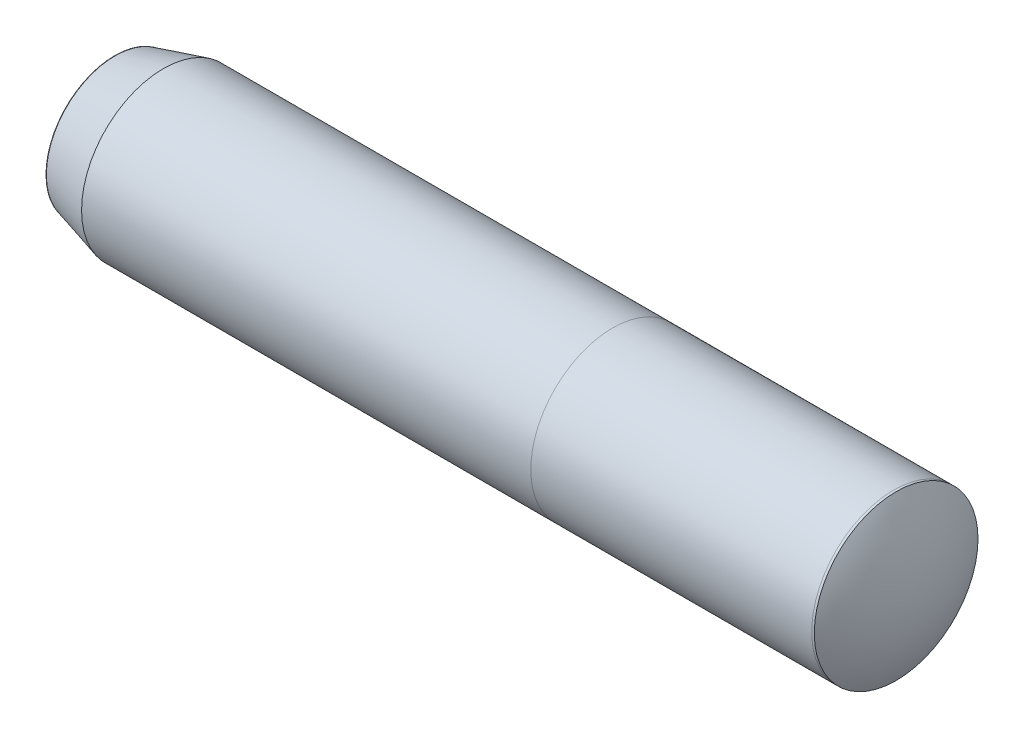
ISO-10303-21;
HEADER;
FILE_DESCRIPTION(('STEP AP214'),'2;1');
FILE_NAME('part.step','',(''),(''),'','','');
FILE_SCHEMA(('AUTOMOTIVE_DESIGN { 1 0 10303 214 1 1 1 1 }'));
ENDSEC;
DATA;
#1=APPLICATION_CONTEXT('core data for automotive mechanical design processes');
#2=APPLICATION_PROTOCOL_DEFINITION('international standard','automotive_design',2000,#1);
#3=PRODUCT_CONTEXT('',#1,'mechanical');
#4=PRODUCT('Part','Part','',(#3));
#5=PRODUCT_RELATED_PRODUCT_CATEGORY('part','',(#4));
#6=PRODUCT_DEFINITION_FORMATION('','',#4);
#7=PRODUCT_DEFINITION_CONTEXT('part definition',#1,'design');
#8=PRODUCT_DEFINITION('design','',#6,#7);
#9=PRODUCT_DEFINITION_SHAPE('','',#8);
#10=(LENGTH_UNIT() NAMED_UNIT(*) SI_UNIT(.MILLI.,.METRE.));
#11=(NAMED_UNIT(*) PLANE_ANGLE_UNIT() SI_UNIT($,.RADIAN.));
#12=(NAMED_UNIT(*) SI_UNIT($,.STERADIAN.) SOLID_ANGLE_UNIT());
#13=UNCERTAINTY_MEASURE_WITH_UNIT(LENGTH_MEASURE(1.E-05),#10,'distance_accuracy_value','');
#14=(GEOMETRIC_REPRESENTATION_CONTEXT(3) GLOBAL_UNCERTAINTY_ASSIGNED_CONTEXT((#13)) GLOBAL_UNIT_ASSIGNED_CONTEXT((#10,
#11,#12)) REPRESENTATION_CONTEXT('',''));
#15=CARTESIAN_POINT('',(0.,0.,0.));
#16=DIRECTION('',(0.,0.,1.));
#17=DIRECTION('',(1.,0.,0.));
#18=AXIS2_PLACEMENT_3D('',#15,#16,#17);
#19=CARTESIAN_POINT('',(0.78,0.,0.));
#20=DIRECTION('',(1.,0.,0.));
#21=DIRECTION('',(0.,1.,0.));
#22=AXIS2_PLACEMENT_3D('',#19,#20,#21);
#23=CYLINDRICAL_SURFACE('',#22,1.);
#24=CARTESIAN_POINT('',(9.7,0.,0.));
#25=DIRECTION('',(1.,0.,0.));
#26=DIRECTION('',(0.,0.,-1.));
#27=AXIS2_PLACEMENT_3D('',#24,#25,#26);
#28=CIRCLE('',#27,1.);
#29=CARTESIAN_POINT('',(9.7,0.,-0.999999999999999));
#30=VERTEX_POINT('',#29);
#31=EDGE_CURVE('E20',#30,#30,#28,.T.);
#32=ORIENTED_EDGE('',*,*,#31,.F.);
#33=EDGE_LOOP('',(#32));
#34=FACE_BOUND('',#33,.T.);
#35=CARTESIAN_POINT('',(6.26794919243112,0.,0.));
#36=DIRECTION('',(1.,0.,0.));
#37=DIRECTION('',(0.,0.,-1.));
#38=AXIS2_PLACEMENT_3D('',#35,#36,#37);
#39=CIRCLE('',#38,1.);
#40=CARTESIAN_POINT('',(6.26794919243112,0.,-1.));
#41=VERTEX_POINT('',#40);
#42=EDGE_CURVE('E9',#41,#41,#39,.T.);
#43=ORIENTED_EDGE('',*,*,#42,.T.);
#44=EDGE_LOOP('',(#43));
#45=FACE_BOUND('',#44,.T.);
#46=ADVANCED_FACE('F13',(#34,#45),#23,.T.);
#47=ORIENTED_EDGE('',*,*,#42,.F.);
#48=EDGE_LOOP('',(#47));
#49=FACE_BOUND('',#48,.T.);
#50=CARTESIAN_POINT('',(0.78,0.,0.));
#51=DIRECTION('',(-1.,0.,0.));
#52=DIRECTION('',(0.,0.,1.));
#53=AXIS2_PLACEMENT_3D('',#50,#51,#52);
#54=CIRCLE('',#53,1.);
#55=CARTESIAN_POINT('',(0.78,0.,1.));
#56=VERTEX_POINT('',#55);
#57=EDGE_CURVE('E28',#56,#56,#54,.T.);
#58=ORIENTED_EDGE('',*,*,#57,.F.);
#59=EDGE_LOOP('',(#58));
#60=FACE_BOUND('',#59,.T.);
#61=ADVANCED_FACE('F15',(#49,#60),#23,.T.);
#62=CARTESIAN_POINT('',(8.,0.,0.));
#63=DIRECTION('',(1.,0.,0.));
#64=DIRECTION('',(0.,0.,-1.));
#65=AXIS2_PLACEMENT_3D('',#62,#63,#64);
#66=SPHERICAL_SURFACE('',#65,2.);
#67=CARTESIAN_POINT('',(9.73205080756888,0.,0.));
#68=DIRECTION('',(-1.,0.,0.));
#69=DIRECTION('',(0.,0.,1.));
#70=AXIS2_PLACEMENT_3D('',#67,#68,#69);
#71=CIRCLE('',#70,1.);
#72=CARTESIAN_POINT('',(9.73205080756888,0.,1.));
#73=VERTEX_POINT('',#72);
#74=EDGE_CURVE('E24',#73,#73,#71,.F.);
#75=ORIENTED_EDGE('',*,*,#74,.T.);
#76=EDGE_LOOP('',(#75));
#77=FACE_BOUND('',#76,.T.);
#78=ADVANCED_FACE('F59',(#77),#66,.T.);
#79=CARTESIAN_POINT('',(0.,0.,0.));
#80=DIRECTION('',(1.,0.,0.));
#81=DIRECTION('',(0.,1.,0.));
#82=AXIS2_PLACEMENT_3D('',#79,#80,#81);
#83=CYLINDRICAL_SURFACE('',#82,1.);
#84=ORIENTED_EDGE('',*,*,#31,.T.);
#85=EDGE_LOOP('',(#84));
#86=FACE_BOUND('',#85,.T.);
#87=ORIENTED_EDGE('',*,*,#74,.F.);
#88=EDGE_LOOP('',(#87));
#89=FACE_BOUND('',#88,.T.);
#90=ADVANCED_FACE('F52',(#86,#89),#83,.T.);
#91=CARTESIAN_POINT('',(0.189,0.,0.));
#92=DIRECTION('',(1.,0.,0.));
#93=DIRECTION('',(0.,0.,-1.));
#94=AXIS2_PLACEMENT_3D('',#91,#92,#93);
#95=CONICAL_SURFACE('',#94,0.839230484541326,0.265602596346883);
#96=ORIENTED_EDGE('',*,*,#57,.T.);
#97=EDGE_LOOP('',(#96));
#98=FACE_BOUND('',#97,.T.);
#99=CARTESIAN_POINT('',(0.189,0.,0.));
#100=DIRECTION('',(-1.,0.,0.));
#101=DIRECTION('',(0.,0.,1.));
#102=AXIS2_PLACEMENT_3D('',#99,#100,#101);
#103=CIRCLE('',#102,0.839230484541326);
#104=CARTESIAN_POINT('',(0.189,0.,0.839230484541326));
#105=VERTEX_POINT('',#104);
#106=EDGE_CURVE('E33',#105,#105,#103,.T.);
#107=ORIENTED_EDGE('',*,*,#106,.F.);
#108=EDGE_LOOP('',(#107));
#109=FACE_BOUND('',#108,.T.);
#110=ADVANCED_FACE('F44',(#98,#109),#95,.T.);
#111=CARTESIAN_POINT('',(-10.,0.,0.));
#112=DIRECTION('',(1.,0.,0.));
#113=DIRECTION('',(0.,1.,0.));
#114=AXIS2_PLACEMENT_3D('',#111,#112,#113);
#115=CYLINDRICAL_SURFACE('',#114,0.839230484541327);
#116=ORIENTED_EDGE('',*,*,#106,.T.);
#117=EDGE_LOOP('',(#116));
#118=FACE_BOUND('',#117,.T.);
#119=CARTESIAN_POINT('',(0.184595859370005,0.,0.));
#120=DIRECTION('',(1.,0.,0.));
#121=DIRECTION('',(0.,0.,-1.));
#122=AXIS2_PLACEMENT_3D('',#119,#120,#121);
#123=CIRCLE('',#122,0.839230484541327);
#124=CARTESIAN_POINT('',(0.184595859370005,0.,-0.839230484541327));
#125=VERTEX_POINT('',#124);
#126=EDGE_CURVE('E36',#125,#125,#123,.F.);
#127=ORIENTED_EDGE('',*,*,#126,.F.);
#128=EDGE_LOOP('',(#127));
#129=FACE_BOUND('',#128,.T.);
#130=ADVANCED_FACE('F42',(#118,#129),#115,.T.);
#131=CARTESIAN_POINT('',(2.,0.,0.));
#132=DIRECTION('',(1.,0.,0.));
#133=DIRECTION('',(0.,0.,-1.));
#134=AXIS2_PLACEMENT_3D('',#131,#132,#133);
#135=SPHERICAL_SURFACE('',#134,2.);
#136=ORIENTED_EDGE('',*,*,#126,.T.);
#137=EDGE_LOOP('',(#136));
#138=FACE_BOUND('',#137,.T.);
#139=ADVANCED_FACE('F40',(#138),#135,.T.);
#140=CLOSED_SHELL('',(#46,#61,#78,#90,#110,#130,#139));
#141=MANIFOLD_SOLID_BREP('B1',#140);
#142=ADVANCED_BREP_SHAPE_REPRESENTATION('',(#18,#141),#14);
#143=SHAPE_DEFINITION_REPRESENTATION(#9,#142);
ENDSEC;
END-ISO-10303-21;
